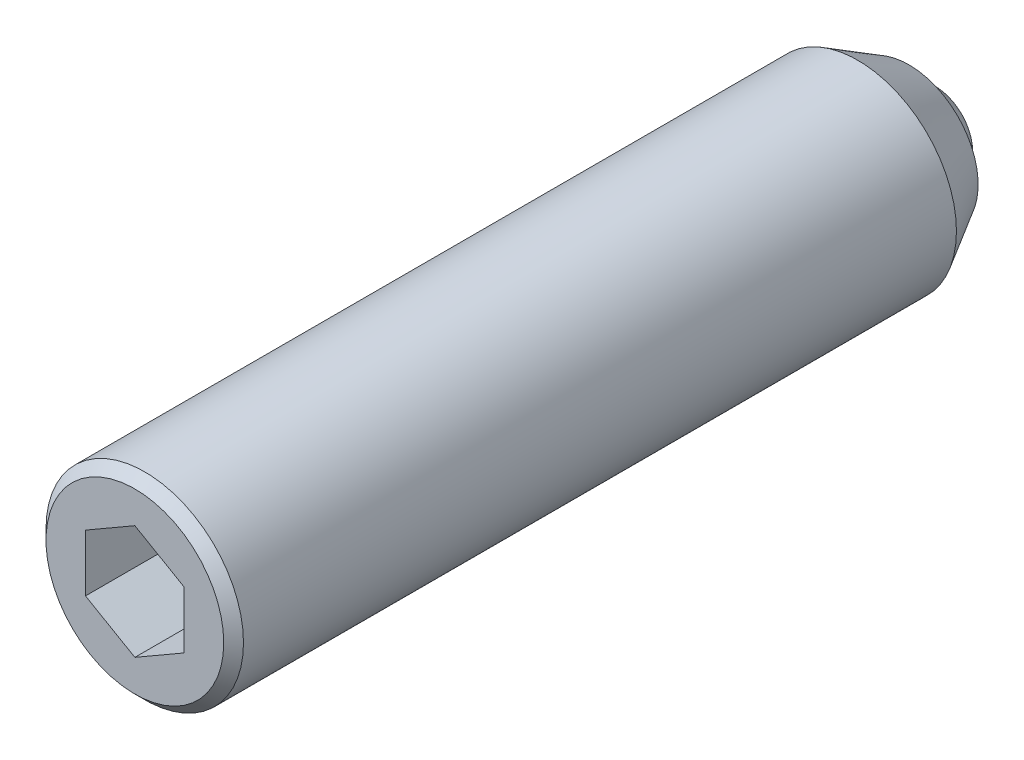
ISO-10303-21;
HEADER;
FILE_DESCRIPTION(('STEP AP214'),'2;1');
FILE_NAME('part.step','',(''),(''),'','','');
FILE_SCHEMA(('AUTOMOTIVE_DESIGN { 1 0 10303 214 1 1 1 1 }'));
ENDSEC;
DATA;
#1=APPLICATION_CONTEXT('core data for automotive mechanical design processes');
#2=APPLICATION_PROTOCOL_DEFINITION('international standard','automotive_design',2000,#1);
#3=PRODUCT_CONTEXT('',#1,'mechanical');
#4=PRODUCT('Part','Part','',(#3));
#5=PRODUCT_RELATED_PRODUCT_CATEGORY('part','',(#4));
#6=PRODUCT_DEFINITION_FORMATION('','',#4);
#7=PRODUCT_DEFINITION_CONTEXT('part definition',#1,'design');
#8=PRODUCT_DEFINITION('design','',#6,#7);
#9=PRODUCT_DEFINITION_SHAPE('','',#8);
#10=(LENGTH_UNIT() NAMED_UNIT(*) SI_UNIT(.MILLI.,.METRE.));
#11=(NAMED_UNIT(*) PLANE_ANGLE_UNIT() SI_UNIT($,.RADIAN.));
#12=(NAMED_UNIT(*) SI_UNIT($,.STERADIAN.) SOLID_ANGLE_UNIT());
#13=UNCERTAINTY_MEASURE_WITH_UNIT(LENGTH_MEASURE(1.E-05),#10,'distance_accuracy_value','');
#14=(GEOMETRIC_REPRESENTATION_CONTEXT(3) GLOBAL_UNCERTAINTY_ASSIGNED_CONTEXT((#13)) GLOBAL_UNIT_ASSIGNED_CONTEXT((#10,
#11,#12)) REPRESENTATION_CONTEXT('',''));
#15=CARTESIAN_POINT('',(0.,0.,0.));
#16=DIRECTION('',(0.,0.,1.));
#17=DIRECTION('',(1.,0.,0.));
#18=AXIS2_PLACEMENT_3D('',#15,#16,#17);
#19=CARTESIAN_POINT('',(1.25,0.721687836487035,18.1));
#20=DIRECTION('',(0.5,0.866025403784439,0.));
#21=DIRECTION('',(0.866025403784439,-0.5,0.));
#22=AXIS2_PLACEMENT_3D('',#19,#20,#21);
#23=PLANE('',#22);
#24=DIRECTION('',(0.,0.,1.));
#25=VECTOR('',#24,1.);
#26=CARTESIAN_POINT('',(1.25,0.721687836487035,18.1));
#27=LINE('',#26,#25);
#28=CARTESIAN_POINT('',(1.25,0.721687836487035,18.1));
#29=VERTEX_POINT('',#28);
#30=CARTESIAN_POINT('',(1.25,0.721687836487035,20.6));
#31=VERTEX_POINT('',#30);
#32=EDGE_CURVE('E96',#29,#31,#27,.T.);
#33=ORIENTED_EDGE('',*,*,#32,.T.);
#34=DIRECTION('',(-0.866025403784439,0.5,0.));
#35=VECTOR('',#34,1.);
#36=CARTESIAN_POINT('',(1.25,0.721687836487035,20.6));
#37=LINE('',#36,#35);
#38=CARTESIAN_POINT('',(0.,1.44337567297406,20.6));
#39=VERTEX_POINT('',#38);
#40=EDGE_CURVE('E29',#31,#39,#37,.T.);
#41=ORIENTED_EDGE('',*,*,#40,.T.);
#42=DIRECTION('',(0.,0.,1.));
#43=VECTOR('',#42,1.);
#44=CARTESIAN_POINT('',(0.,1.44337567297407,18.1));
#45=LINE('',#44,#43);
#46=CARTESIAN_POINT('',(0.,1.44337567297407,18.1));
#47=VERTEX_POINT('',#46);
#48=EDGE_CURVE('E34',#47,#39,#45,.T.);
#49=ORIENTED_EDGE('',*,*,#48,.F.);
#50=DIRECTION('',(-0.866025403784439,0.5,0.));
#51=VECTOR('',#50,1.);
#52=CARTESIAN_POINT('',(1.25,0.721687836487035,18.1));
#53=LINE('',#52,#51);
#54=EDGE_CURVE('E90',#29,#47,#53,.T.);
#55=ORIENTED_EDGE('',*,*,#54,.F.);
#56=EDGE_LOOP('',(#33,#41,#49,#55));
#57=FACE_BOUND('',#56,.T.);
#58=ADVANCED_FACE('F14',(#57),#23,.F.);
#59=CARTESIAN_POINT('',(1.25,-0.721687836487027,18.1));
#60=DIRECTION('',(1.,0.,0.));
#61=DIRECTION('',(0.,-1.,0.));
#62=AXIS2_PLACEMENT_3D('',#59,#60,#61);
#63=PLANE('',#62);
#64=DIRECTION('',(0.,0.,1.));
#65=VECTOR('',#64,1.);
#66=CARTESIAN_POINT('',(1.25,-0.721687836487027,18.1));
#67=LINE('',#66,#65);
#68=CARTESIAN_POINT('',(1.25,-0.721687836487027,18.1));
#69=VERTEX_POINT('',#68);
#70=CARTESIAN_POINT('',(1.25,-0.721687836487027,20.6));
#71=VERTEX_POINT('',#70);
#72=EDGE_CURVE('E93',#69,#71,#67,.T.);
#73=ORIENTED_EDGE('',*,*,#72,.T.);
#74=DIRECTION('',(0.,1.,0.));
#75=VECTOR('',#74,1.);
#76=CARTESIAN_POINT('',(1.25,-0.721687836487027,20.6));
#77=LINE('',#76,#75);
#78=EDGE_CURVE('E150',#71,#31,#77,.T.);
#79=ORIENTED_EDGE('',*,*,#78,.T.);
#80=ORIENTED_EDGE('',*,*,#32,.F.);
#81=DIRECTION('',(0.,1.,0.));
#82=VECTOR('',#81,1.);
#83=CARTESIAN_POINT('',(1.25,-0.721687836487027,18.1));
#84=LINE('',#83,#82);
#85=EDGE_CURVE('E85',#69,#29,#84,.T.);
#86=ORIENTED_EDGE('',*,*,#85,.F.);
#87=EDGE_LOOP('',(#73,#79,#80,#86));
#88=FACE_BOUND('',#87,.T.);
#89=ADVANCED_FACE('F119',(#88),#63,.F.);
#90=CARTESIAN_POINT('',(1.25,-0.721687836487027,18.1));
#91=DIRECTION('',(-0.5,0.866025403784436,0.));
#92=DIRECTION('',(0.866025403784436,0.5,0.));
#93=AXIS2_PLACEMENT_3D('',#90,#91,#92);
#94=PLANE('',#93);
#95=DIRECTION('',(0.,0.,1.));
#96=VECTOR('',#95,1.);
#97=CARTESIAN_POINT('',(0.,-1.44337567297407,18.1));
#98=LINE('',#97,#96);
#99=CARTESIAN_POINT('',(0.,-1.44337567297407,18.1));
#100=VERTEX_POINT('',#99);
#101=CARTESIAN_POINT('',(0.,-1.44337567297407,20.6));
#102=VERTEX_POINT('',#101);
#103=EDGE_CURVE('E68',#100,#102,#98,.T.);
#104=ORIENTED_EDGE('',*,*,#103,.T.);
#105=DIRECTION('',(-0.866025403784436,-0.5,0.));
#106=VECTOR('',#105,1.);
#107=CARTESIAN_POINT('',(1.25,-0.721687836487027,20.6));
#108=LINE('',#107,#106);
#109=EDGE_CURVE('E144',#71,#102,#108,.T.);
#110=ORIENTED_EDGE('',*,*,#109,.F.);
#111=ORIENTED_EDGE('',*,*,#72,.F.);
#112=DIRECTION('',(-0.866025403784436,-0.5,0.));
#113=VECTOR('',#112,1.);
#114=CARTESIAN_POINT('',(1.25,-0.721687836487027,18.1));
#115=LINE('',#114,#113);
#116=EDGE_CURVE('E83',#69,#100,#115,.T.);
#117=ORIENTED_EDGE('',*,*,#116,.T.);
#118=EDGE_LOOP('',(#104,#110,#111,#117));
#119=FACE_BOUND('',#118,.T.);
#120=ADVANCED_FACE('F124',(#119),#94,.T.);
#121=CARTESIAN_POINT('',(-1.25,-0.721687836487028,18.1));
#122=DIRECTION('',(-0.5,-0.866025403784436,0.));
#123=DIRECTION('',(-0.866025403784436,0.5,0.));
#124=AXIS2_PLACEMENT_3D('',#121,#122,#123);
#125=PLANE('',#124);
#126=DIRECTION('',(0.,0.,1.));
#127=VECTOR('',#126,1.);
#128=CARTESIAN_POINT('',(-1.25,-0.721687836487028,18.1));
#129=LINE('',#128,#127);
#130=CARTESIAN_POINT('',(-1.25,-0.721687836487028,18.1));
#131=VERTEX_POINT('',#130);
#132=CARTESIAN_POINT('',(-1.25,-0.721687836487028,20.6));
#133=VERTEX_POINT('',#132);
#134=EDGE_CURVE('E56',#131,#133,#129,.T.);
#135=ORIENTED_EDGE('',*,*,#134,.T.);
#136=DIRECTION('',(0.866025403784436,-0.5,0.));
#137=VECTOR('',#136,1.);
#138=CARTESIAN_POINT('',(-1.25,-0.721687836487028,20.6));
#139=LINE('',#138,#137);
#140=EDGE_CURVE('E147',#133,#102,#139,.T.);
#141=ORIENTED_EDGE('',*,*,#140,.T.);
#142=ORIENTED_EDGE('',*,*,#103,.F.);
#143=DIRECTION('',(0.866025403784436,-0.5,0.));
#144=VECTOR('',#143,1.);
#145=CARTESIAN_POINT('',(-1.25,-0.721687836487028,18.1));
#146=LINE('',#145,#144);
#147=EDGE_CURVE('E76',#131,#100,#146,.T.);
#148=ORIENTED_EDGE('',*,*,#147,.F.);
#149=EDGE_LOOP('',(#135,#141,#142,#148));
#150=FACE_BOUND('',#149,.T.);
#151=ADVANCED_FACE('F81',(#150),#125,.F.);
#152=CARTESIAN_POINT('',(-1.25,-0.721687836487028,18.1));
#153=DIRECTION('',(1.,0.,0.));
#154=DIRECTION('',(0.,0.,1.));
#155=AXIS2_PLACEMENT_3D('',#152,#153,#154);
#156=PLANE('',#155);
#157=DIRECTION('',(0.,0.,1.));
#158=VECTOR('',#157,1.);
#159=CARTESIAN_POINT('',(-1.25,0.72168783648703,18.1));
#160=LINE('',#159,#158);
#161=CARTESIAN_POINT('',(-1.25,0.72168783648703,18.1));
#162=VERTEX_POINT('',#161);
#163=CARTESIAN_POINT('',(-1.25,0.72168783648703,20.6));
#164=VERTEX_POINT('',#163);
#165=EDGE_CURVE('E69',#162,#164,#160,.T.);
#166=ORIENTED_EDGE('',*,*,#165,.T.);
#167=DIRECTION('',(0.,1.,0.));
#168=VECTOR('',#167,1.);
#169=CARTESIAN_POINT('',(-1.25,-0.721687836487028,20.6));
#170=LINE('',#169,#168);
#171=EDGE_CURVE('E63',#133,#164,#170,.T.);
#172=ORIENTED_EDGE('',*,*,#171,.F.);
#173=ORIENTED_EDGE('',*,*,#134,.F.);
#174=DIRECTION('',(0.,1.,0.));
#175=VECTOR('',#174,1.);
#176=CARTESIAN_POINT('',(-1.25,-0.721687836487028,18.1));
#177=LINE('',#176,#175);
#178=EDGE_CURVE('E60',#131,#162,#177,.T.);
#179=ORIENTED_EDGE('',*,*,#178,.T.);
#180=EDGE_LOOP('',(#166,#172,#173,#179));
#181=FACE_BOUND('',#180,.T.);
#182=ADVANCED_FACE('F59',(#181),#156,.T.);
#183=CARTESIAN_POINT('',(-1.25,0.72168783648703,18.1));
#184=DIRECTION('',(0.5,-0.866025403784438,0.));
#185=DIRECTION('',(-0.866025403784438,-0.5,0.));
#186=AXIS2_PLACEMENT_3D('',#183,#184,#185);
#187=PLANE('',#186);
#188=DIRECTION('',(0.866025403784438,0.5,0.));
#189=VECTOR('',#188,1.);
#190=CARTESIAN_POINT('',(-1.25,0.72168783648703,18.1));
#191=LINE('',#190,#189);
#192=EDGE_CURVE('E79',#162,#47,#191,.T.);
#193=ORIENTED_EDGE('',*,*,#192,.T.);
#194=ORIENTED_EDGE('',*,*,#48,.T.);
#195=DIRECTION('',(0.866025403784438,0.5,0.));
#196=VECTOR('',#195,1.);
#197=CARTESIAN_POINT('',(-1.25,0.72168783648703,20.6));
#198=LINE('',#197,#196);
#199=EDGE_CURVE('E157',#164,#39,#198,.T.);
#200=ORIENTED_EDGE('',*,*,#199,.F.);
#201=ORIENTED_EDGE('',*,*,#165,.F.);
#202=EDGE_LOOP('',(#193,#194,#200,#201));
#203=FACE_BOUND('',#202,.T.);
#204=ADVANCED_FACE('F128',(#203),#187,.T.);
#205=CARTESIAN_POINT('',(2.5,0.,18.1));
#206=DIRECTION('',(0.,0.,1.));
#207=DIRECTION('',(-1.,0.,0.));
#208=AXIS2_PLACEMENT_3D('',#205,#206,#207);
#209=PLANE('',#208);
#210=ORIENTED_EDGE('',*,*,#54,.T.);
#211=ORIENTED_EDGE('',*,*,#192,.F.);
#212=ORIENTED_EDGE('',*,*,#178,.F.);
#213=ORIENTED_EDGE('',*,*,#147,.T.);
#214=ORIENTED_EDGE('',*,*,#116,.F.);
#215=ORIENTED_EDGE('',*,*,#85,.T.);
#216=EDGE_LOOP('',(#210,#211,#212,#213,#214,#215));
#217=FACE_BOUND('',#216,.T.);
#218=ADVANCED_FACE('F74',(#217),#209,.T.);
#219=CARTESIAN_POINT('',(0.,0.,20.35));
#220=DIRECTION('',(0.,0.,-1.));
#221=DIRECTION('',(1.,0.,0.));
#222=AXIS2_PLACEMENT_3D('',#219,#220,#221);
#223=CYLINDRICAL_SURFACE('',#222,2.5);
#224=CARTESIAN_POINT('',(0.,0.,20.35));
#225=DIRECTION('',(0.,0.,-1.));
#226=DIRECTION('',(1.,0.,0.));
#227=AXIS2_PLACEMENT_3D('',#224,#225,#226);
#228=CIRCLE('',#227,2.5);
#229=CARTESIAN_POINT('',(2.5,0.,20.35));
#230=VERTEX_POINT('',#229);
#231=EDGE_CURVE('E9',#230,#230,#228,.T.);
#232=ORIENTED_EDGE('',*,*,#231,.T.);
#233=EDGE_LOOP('',(#232));
#234=FACE_BOUND('',#233,.T.);
#235=CARTESIAN_POINT('',(0.,0.,2.29903810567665));
#236=DIRECTION('',(0.,0.,-1.));
#237=DIRECTION('',(-1.,0.,0.));
#238=AXIS2_PLACEMENT_3D('',#235,#236,#237);
#239=CIRCLE('',#238,2.5);
#240=CARTESIAN_POINT('',(-2.5,0.,2.29903810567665));
#241=VERTEX_POINT('',#240);
#242=EDGE_CURVE('E172',#241,#241,#239,.T.);
#243=ORIENTED_EDGE('',*,*,#242,.F.);
#244=EDGE_LOOP('',(#243));
#245=FACE_BOUND('',#244,.T.);
#246=ADVANCED_FACE('F16',(#234,#245),#223,.T.);
#247=CARTESIAN_POINT('',(0.,0.,20.35));
#248=DIRECTION('',(0.,0.,-1.));
#249=DIRECTION('',(1.,0.,0.));
#250=AXIS2_PLACEMENT_3D('',#247,#248,#249);
#251=CONICAL_SURFACE('',#250,2.5,0.785398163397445);
#252=CARTESIAN_POINT('',(0.,0.,20.6));
#253=DIRECTION('',(0.,0.,-1.));
#254=DIRECTION('',(1.,0.,0.));
#255=AXIS2_PLACEMENT_3D('',#252,#253,#254);
#256=CIRCLE('',#255,2.25);
#257=CARTESIAN_POINT('',(2.25,0.,20.6));
#258=VERTEX_POINT('',#257);
#259=EDGE_CURVE('E22',#258,#258,#256,.T.);
#260=ORIENTED_EDGE('',*,*,#259,.T.);
#261=EDGE_LOOP('',(#260));
#262=FACE_BOUND('',#261,.T.);
#263=ORIENTED_EDGE('',*,*,#231,.F.);
#264=EDGE_LOOP('',(#263));
#265=FACE_BOUND('',#264,.T.);
#266=ADVANCED_FACE('F100',(#262,#265),#251,.T.);
#267=CARTESIAN_POINT('',(0.,0.,20.6));
#268=DIRECTION('',(0.,0.,-1.));
#269=DIRECTION('',(1.,0.,0.));
#270=AXIS2_PLACEMENT_3D('',#267,#268,#269);
#271=PLANE('',#270);
#272=ORIENTED_EDGE('',*,*,#199,.T.);
#273=ORIENTED_EDGE('',*,*,#40,.F.);
#274=ORIENTED_EDGE('',*,*,#78,.F.);
#275=ORIENTED_EDGE('',*,*,#109,.T.);
#276=ORIENTED_EDGE('',*,*,#140,.F.);
#277=ORIENTED_EDGE('',*,*,#171,.T.);
#278=EDGE_LOOP('',(#272,#273,#274,#275,#276,#277));
#279=FACE_BOUND('',#278,.T.);
#280=ORIENTED_EDGE('',*,*,#259,.F.);
#281=EDGE_LOOP('',(#280));
#282=FACE_BOUND('',#281,.T.);
#283=ADVANCED_FACE('F103',(#279,#282),#271,.F.);
#284=CARTESIAN_POINT('',(0.,0.,1.5));
#285=DIRECTION('',(0.,0.,-1.));
#286=DIRECTION('',(-1.,0.,0.));
#287=AXIS2_PLACEMENT_3D('',#284,#285,#286);
#288=SPHERICAL_SURFACE('',#287,1.5);
#289=CARTESIAN_POINT('',(0.,0.,1.));
#290=DIRECTION('',(0.,0.,-1.));
#291=DIRECTION('',(-1.,0.,0.));
#292=AXIS2_PLACEMENT_3D('',#289,#290,#291);
#293=CIRCLE('',#292,1.41421356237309);
#294=CARTESIAN_POINT('',(-1.41421356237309,0.,1.));
#295=VERTEX_POINT('',#294);
#296=EDGE_CURVE('E152',#295,#295,#293,.T.);
#297=ORIENTED_EDGE('',*,*,#296,.T.);
#298=EDGE_LOOP('',(#297));
#299=FACE_BOUND('',#298,.T.);
#300=ADVANCED_FACE('F105',(#299),#288,.T.);
#301=CARTESIAN_POINT('',(-1.41421356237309,0.,1.));
#302=DIRECTION('',(0.,0.,-1.));
#303=DIRECTION('',(-1.,0.,0.));
#304=AXIS2_PLACEMENT_3D('',#301,#302,#303);
#305=PLANE('',#304);
#306=CARTESIAN_POINT('',(0.,0.,1.));
#307=DIRECTION('',(0.,0.,-1.));
#308=DIRECTION('',(-1.,0.,0.));
#309=AXIS2_PLACEMENT_3D('',#306,#307,#308);
#310=CIRCLE('',#309,1.75);
#311=CARTESIAN_POINT('',(-1.75,0.,1.));
#312=VERTEX_POINT('',#311);
#313=EDGE_CURVE('E169',#312,#312,#310,.T.);
#314=ORIENTED_EDGE('',*,*,#313,.T.);
#315=EDGE_LOOP('',(#314));
#316=FACE_BOUND('',#315,.T.);
#317=ORIENTED_EDGE('',*,*,#296,.F.);
#318=EDGE_LOOP('',(#317));
#319=FACE_BOUND('',#318,.T.);
#320=ADVANCED_FACE('F113',(#316,#319),#305,.T.);
#321=CARTESIAN_POINT('',(0.,0.,1.));
#322=DIRECTION('',(0.,0.,1.));
#323=DIRECTION('',(1.,0.,0.));
#324=AXIS2_PLACEMENT_3D('',#321,#322,#323);
#325=CONICAL_SURFACE('',#324,1.75,0.523598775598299);
#326=ORIENTED_EDGE('',*,*,#242,.T.);
#327=EDGE_LOOP('',(#326));
#328=FACE_BOUND('',#327,.T.);
#329=ORIENTED_EDGE('',*,*,#313,.F.);
#330=EDGE_LOOP('',(#329));
#331=FACE_BOUND('',#330,.T.);
#332=ADVANCED_FACE('F176',(#328,#331),#325,.T.);
#333=CLOSED_SHELL('',(#58,#89,#120,#151,#182,#204,#218,#246,#266,#283,#300,#320,#332));
#334=MANIFOLD_SOLID_BREP('B1',#333);
#335=ADVANCED_BREP_SHAPE_REPRESENTATION('',(#18,#334),#14);
#336=SHAPE_DEFINITION_REPRESENTATION(#9,#335);
ENDSEC;
END-ISO-10303-21;
